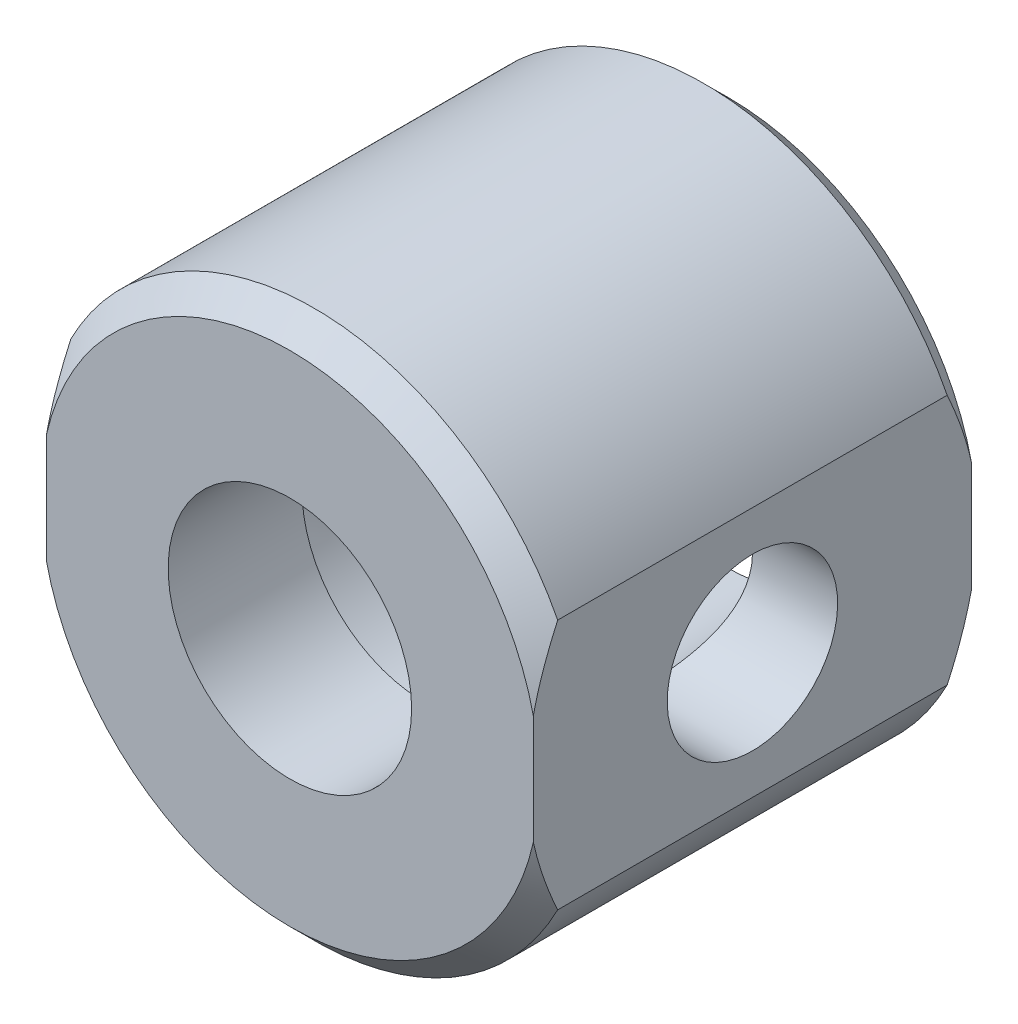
ISO-10303-21;
HEADER;
FILE_DESCRIPTION(('STEP AP214'),'2;1');
FILE_NAME('part.step','',(''),(''),'','','');
FILE_SCHEMA(('AUTOMOTIVE_DESIGN { 1 0 10303 214 1 1 1 1 }'));
ENDSEC;
DATA;
#1=APPLICATION_CONTEXT('core data for automotive mechanical design processes');
#2=APPLICATION_PROTOCOL_DEFINITION('international standard','automotive_design',2000,#1);
#3=PRODUCT_CONTEXT('',#1,'mechanical');
#4=PRODUCT('Part','Part','',(#3));
#5=PRODUCT_RELATED_PRODUCT_CATEGORY('part','',(#4));
#6=PRODUCT_DEFINITION_FORMATION('','',#4);
#7=PRODUCT_DEFINITION_CONTEXT('part definition',#1,'design');
#8=PRODUCT_DEFINITION('design','',#6,#7);
#9=PRODUCT_DEFINITION_SHAPE('','',#8);
#10=(LENGTH_UNIT() NAMED_UNIT(*) SI_UNIT(.MILLI.,.METRE.));
#11=(NAMED_UNIT(*) PLANE_ANGLE_UNIT() SI_UNIT($,.RADIAN.));
#12=(NAMED_UNIT(*) SI_UNIT($,.STERADIAN.) SOLID_ANGLE_UNIT());
#13=UNCERTAINTY_MEASURE_WITH_UNIT(LENGTH_MEASURE(1.E-05),#10,'distance_accuracy_value','');
#14=(GEOMETRIC_REPRESENTATION_CONTEXT(3) GLOBAL_UNCERTAINTY_ASSIGNED_CONTEXT((#13)) GLOBAL_UNIT_ASSIGNED_CONTEXT((#10,
#11,#12)) REPRESENTATION_CONTEXT('',''));
#15=CARTESIAN_POINT('',(0.,0.,0.));
#16=DIRECTION('',(0.,0.,1.));
#17=DIRECTION('',(1.,0.,0.));
#18=AXIS2_PLACEMENT_3D('',#15,#16,#17);
#19=CARTESIAN_POINT('',(0.,0.,36.));
#20=DIRECTION('',(0.,0.,-1.));
#21=DIRECTION('',(-1.,0.,0.));
#22=AXIS2_PLACEMENT_3D('',#19,#20,#21);
#23=CYLINDRICAL_SURFACE('',#22,22.5);
#24=CARTESIAN_POINT('',(0.,0.,34.));
#25=DIRECTION('',(0.,0.,1.));
#26=DIRECTION('',(1.,0.,0.));
#27=AXIS2_PLACEMENT_3D('',#24,#25,#26);
#28=CIRCLE('',#27,22.5);
#29=CARTESIAN_POINT('',(20.,-10.3077640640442,34.));
#30=VERTEX_POINT('',#29);
#31=CARTESIAN_POINT('',(-20.,-10.3077640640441,34.));
#32=VERTEX_POINT('',#31);
#33=EDGE_CURVE('E200',#30,#32,#28,.F.);
#34=ORIENTED_EDGE('',*,*,#33,.T.);
#35=DIRECTION('',(0.,0.,-1.));
#36=VECTOR('',#35,1.);
#37=CARTESIAN_POINT('',(-20.,-10.3077640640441,36.));
#38=LINE('',#37,#36);
#39=CARTESIAN_POINT('',(-20.,-10.3077640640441,2.));
#40=VERTEX_POINT('',#39);
#41=EDGE_CURVE('E179',#32,#40,#38,.T.);
#42=ORIENTED_EDGE('',*,*,#41,.T.);
#43=CARTESIAN_POINT('',(0.,0.,2.));
#44=DIRECTION('',(0.,0.,1.));
#45=DIRECTION('',(1.,0.,0.));
#46=AXIS2_PLACEMENT_3D('',#43,#44,#45);
#47=CIRCLE('',#46,22.5);
#48=CARTESIAN_POINT('',(20.,-10.3077640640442,2.));
#49=VERTEX_POINT('',#48);
#50=EDGE_CURVE('E202',#40,#49,#47,.T.);
#51=ORIENTED_EDGE('',*,*,#50,.T.);
#52=DIRECTION('',(0.,0.,-1.));
#53=VECTOR('',#52,1.);
#54=CARTESIAN_POINT('',(20.,-10.3077640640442,36.));
#55=LINE('',#54,#53);
#56=EDGE_CURVE('E113',#49,#30,#55,.F.);
#57=ORIENTED_EDGE('',*,*,#56,.T.);
#58=EDGE_LOOP('',(#34,#42,#51,#57));
#59=FACE_BOUND('',#58,.T.);
#60=ADVANCED_FACE('F34',(#59),#23,.T.);
#61=CARTESIAN_POINT('',(0.,0.,36.));
#62=DIRECTION('',(0.,0.,-1.));
#63=DIRECTION('',(-1.,0.,0.));
#64=AXIS2_PLACEMENT_3D('',#61,#62,#63);
#65=CONICAL_SURFACE('',#64,20.5,0.785398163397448);
#66=CARTESIAN_POINT('',(-20.,-14.5963129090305,31.7401060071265));
#67=CARTESIAN_POINT('',(-20.,-14.2319509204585,31.9548727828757));
#68=CARTESIAN_POINT('',(-20.,-13.8652917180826,32.1658043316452));
#69=CARTESIAN_POINT('',(-20.,-13.1269176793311,32.57883982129));
#70=CARTESIAN_POINT('',(-20.,-12.7552015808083,32.7809415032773));
#71=CARTESIAN_POINT('',(-20.,-12.0049087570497,33.1758542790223));
#72=CARTESIAN_POINT('',(-20.,-11.6263102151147,33.3686240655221));
#73=CARTESIAN_POINT('',(-20.,-10.8634186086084,33.742511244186));
#74=CARTESIAN_POINT('',(-20.,-10.4791259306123,33.9236294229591));
#75=CARTESIAN_POINT('',(-20.,-9.6978907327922,34.2755673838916));
#76=CARTESIAN_POINT('',(-20.,-9.30084429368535,34.4461573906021));
#77=CARTESIAN_POINT('',(-20.,-8.50030394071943,34.7716444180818));
#78=CARTESIAN_POINT('',(-20.,-8.09680947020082,34.9265400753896));
#79=CARTESIAN_POINT('',(-20.,-7.28401426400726,35.2182415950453));
#80=CARTESIAN_POINT('',(-20.,-6.87472364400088,35.3550754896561));
#81=CARTESIAN_POINT('',(-20.,-6.05001521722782,35.6086440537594));
#82=CARTESIAN_POINT('',(-20.,-5.6345984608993,35.7253821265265));
#83=CARTESIAN_POINT('',(-20.,-4.71844460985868,35.9565876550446));
#84=CARTESIAN_POINT('',(-20.,-4.21651485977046,36.0663955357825));
#85=CARTESIAN_POINT('',(-20.,-3.2061367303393,36.2507363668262));
#86=CARTESIAN_POINT('',(-20.,-2.69768803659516,36.3252676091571));
#87=CARTESIAN_POINT('',(-20.,-1.68098905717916,36.4357861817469));
#88=CARTESIAN_POINT('',(-20.,-1.17277461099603,36.4720992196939));
#89=CARTESIAN_POINT('',(-20.,-0.155045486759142,36.5058680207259));
#90=CARTESIAN_POINT('',(-20.,0.354469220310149,36.5033229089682));
#91=CARTESIAN_POINT('',(-20.,1.45241488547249,36.4559673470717));
#92=CARTESIAN_POINT('',(-20.,2.04056707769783,36.4045283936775));
#93=CARTESIAN_POINT('',(-20.,3.21044479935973,36.2522797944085));
#94=CARTESIAN_POINT('',(-20.,3.79216900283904,36.1514601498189));
#95=CARTESIAN_POINT('',(-20.,4.9532445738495,35.9036719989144));
#96=CARTESIAN_POINT('',(-20.,5.53247403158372,35.7561389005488));
#97=CARTESIAN_POINT('',(-20.,6.67906381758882,35.4213593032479));
#98=CARTESIAN_POINT('',(-20.,7.24642645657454,35.2341206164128));
#99=CARTESIAN_POINT('',(-20.,8.51334710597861,34.7734123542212));
#100=CARTESIAN_POINT('',(-20.,9.20932637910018,34.4901533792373));
#101=CARTESIAN_POINT('',(-20.,10.5826053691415,33.8811500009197));
#102=CARTESIAN_POINT('',(-20.,11.2598951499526,33.5553835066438));
#103=CARTESIAN_POINT('',(-20.,12.5995112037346,32.8691801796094));
#104=CARTESIAN_POINT('',(-20.,13.2617773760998,32.5086269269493));
#105=CARTESIAN_POINT('',(-20.,14.5708657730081,31.7609305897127));
#106=CARTESIAN_POINT('',(-20.,15.2176907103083,31.3737922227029));
#107=CARTESIAN_POINT('',(-20.,16.4687358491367,30.5965195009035));
#108=CARTESIAN_POINT('',(-20.,17.0735498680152,30.2073359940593));
#109=CARTESIAN_POINT('',(-20.,18.2727911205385,29.4132314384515));
#110=CARTESIAN_POINT('',(-20.,18.8672175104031,29.0083091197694));
#111=CARTESIAN_POINT('',(-20.,20.0420614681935,28.189074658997));
#112=CARTESIAN_POINT('',(-20.,20.6225551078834,27.774871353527));
#113=CARTESIAN_POINT('',(-20.,21.4874680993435,27.1457457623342));
#114=CARTESIAN_POINT('',(-20.,21.7747644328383,26.9347615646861));
#115=CARTESIAN_POINT('',(-20.,22.3475672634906,26.5103884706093));
#116=CARTESIAN_POINT('',(-20.,22.6330737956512,26.296999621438));
#117=CARTESIAN_POINT('',(-20.,22.9177544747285,26.082513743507));
#118=B_SPLINE_CURVE_WITH_KNOTS('',3,(#66,#67,#68,#69,#70,#71,#72,#73,#74,#75,#76,#77,#78,#79,
#80,#81,#82,#83,#84,#85,#86,#87,#88,#89,#90,#91,#92,#93,#94,#95,#96,#97,#98,#99,#100,#101,#102,
#103,#104,#105,#106,#107,#108,#109,#110,#111,#112,#113,#114,#115,#116,#117),.UNSPECIFIED.,.F.,
.F.,(4,2,2,2,2,2,2,2,2,2,2,2,2,2,2,2,2,2,2,2,2,2,2,2,2,4),(0.,1.26886514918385,2.53805302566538,
3.81242352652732,5.08670790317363,6.38283753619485,7.67907967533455,8.97328575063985,
10.2672724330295,11.807502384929,13.3478069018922,14.8748754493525,16.4019783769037,
18.1708834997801,19.9401469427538,21.7316675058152,23.5228359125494,25.7752229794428,
28.0287852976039,30.2901700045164,32.5511544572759,34.7084944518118,36.8660088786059,
39.0052152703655,40.0745421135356,41.1438479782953),.UNSPECIFIED.);
#119=CARTESIAN_POINT('',(-20.,-4.49999999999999,36.));
#120=VERTEX_POINT('',#119);
#121=EDGE_CURVE('E172',#32,#120,#118,.T.);
#122=ORIENTED_EDGE('',*,*,#121,.F.);
#123=ORIENTED_EDGE('',*,*,#33,.F.);
#124=CARTESIAN_POINT('',(20.,-14.5963129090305,31.7401060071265));
#125=CARTESIAN_POINT('',(20.,-14.2319509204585,31.9548727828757));
#126=CARTESIAN_POINT('',(20.,-13.8652917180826,32.1658043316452));
#127=CARTESIAN_POINT('',(20.,-13.1269176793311,32.57883982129));
#128=CARTESIAN_POINT('',(20.,-12.7552015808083,32.7809415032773));
#129=CARTESIAN_POINT('',(20.,-12.0049087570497,33.1758542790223));
#130=CARTESIAN_POINT('',(20.,-11.6263102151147,33.3686240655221));
#131=CARTESIAN_POINT('',(20.,-10.8634186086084,33.742511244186));
#132=CARTESIAN_POINT('',(20.,-10.4791259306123,33.9236294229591));
#133=CARTESIAN_POINT('',(20.,-9.6978907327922,34.2755673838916));
#134=CARTESIAN_POINT('',(20.,-9.30084429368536,34.4461573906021));
#135=CARTESIAN_POINT('',(20.,-8.50030394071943,34.7716444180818));
#136=CARTESIAN_POINT('',(20.,-8.09680947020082,34.9265400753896));
#137=CARTESIAN_POINT('',(20.,-7.28401426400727,35.2182415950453));
#138=CARTESIAN_POINT('',(20.,-6.87472364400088,35.3550754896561));
#139=CARTESIAN_POINT('',(20.,-6.05001521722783,35.6086440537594));
#140=CARTESIAN_POINT('',(20.,-5.6345984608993,35.7253821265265));
#141=CARTESIAN_POINT('',(20.,-4.71844460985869,35.9565876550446));
#142=CARTESIAN_POINT('',(20.,-4.21651485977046,36.0663955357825));
#143=CARTESIAN_POINT('',(20.,-3.2061367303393,36.2507363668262));
#144=CARTESIAN_POINT('',(20.,-2.69768803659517,36.3252676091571));
#145=CARTESIAN_POINT('',(20.,-1.68098905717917,36.4357861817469));
#146=CARTESIAN_POINT('',(20.,-1.17277461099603,36.4720992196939));
#147=CARTESIAN_POINT('',(20.,-0.155045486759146,36.5058680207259));
#148=CARTESIAN_POINT('',(20.,0.354469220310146,36.5033229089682));
#149=CARTESIAN_POINT('',(20.,1.45241488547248,36.4559673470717));
#150=CARTESIAN_POINT('',(20.,2.04056707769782,36.4045283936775));
#151=CARTESIAN_POINT('',(20.,3.21044479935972,36.2522797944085));
#152=CARTESIAN_POINT('',(20.,3.79216900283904,36.1514601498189));
#153=CARTESIAN_POINT('',(20.,4.95324457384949,35.9036719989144));
#154=CARTESIAN_POINT('',(20.,5.53247403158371,35.7561389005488));
#155=CARTESIAN_POINT('',(20.,6.67906381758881,35.4213593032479));
#156=CARTESIAN_POINT('',(20.,7.24642645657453,35.2341206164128));
#157=CARTESIAN_POINT('',(20.,8.5133471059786,34.7734123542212));
#158=CARTESIAN_POINT('',(20.,9.20932637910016,34.4901533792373));
#159=CARTESIAN_POINT('',(20.,10.5826053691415,33.8811500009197));
#160=CARTESIAN_POINT('',(20.,11.2598951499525,33.5553835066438));
#161=CARTESIAN_POINT('',(20.,12.5995112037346,32.8691801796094));
#162=CARTESIAN_POINT('',(20.,13.2617773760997,32.5086269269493));
#163=CARTESIAN_POINT('',(20.,14.5708657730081,31.7609305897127));
#164=CARTESIAN_POINT('',(20.,15.2176907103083,31.3737922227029));
#165=CARTESIAN_POINT('',(20.,16.4687358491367,30.5965195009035));
#166=CARTESIAN_POINT('',(20.,17.0735498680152,30.2073359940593));
#167=CARTESIAN_POINT('',(20.,18.2727911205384,29.4132314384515));
#168=CARTESIAN_POINT('',(20.,18.8672175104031,29.0083091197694));
#169=CARTESIAN_POINT('',(20.,20.0420614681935,28.1890746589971));
#170=CARTESIAN_POINT('',(20.,20.6225551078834,27.774871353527));
#171=CARTESIAN_POINT('',(20.,21.4874680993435,27.1457457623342));
#172=CARTESIAN_POINT('',(20.,21.7747644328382,26.9347615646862));
#173=CARTESIAN_POINT('',(20.,22.3475672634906,26.5103884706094));
#174=CARTESIAN_POINT('',(20.,22.6330737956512,26.296999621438));
#175=CARTESIAN_POINT('',(20.,22.9177544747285,26.082513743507));
#176=B_SPLINE_CURVE_WITH_KNOTS('',3,(#124,#125,#126,#127,#128,#129,#130,#131,#132,#133,#134,
#135,#136,#137,#138,#139,#140,#141,#142,#143,#144,#145,#146,#147,#148,#149,#150,#151,#152,#153,
#154,#155,#156,#157,#158,#159,#160,#161,#162,#163,#164,#165,#166,#167,#168,#169,#170,#171,#172,
#173,#174,#175),.UNSPECIFIED.,.F.,.F.,(4,2,2,2,2,2,2,2,2,2,2,2,2,2,2,2,2,2,2,2,2,2,2,2,2,4),(0.,
1.26886514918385,2.53805302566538,3.81242352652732,5.08670790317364,6.38283753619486,
7.67907967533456,8.97328575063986,10.2672724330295,11.807502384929,13.3478069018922,
14.8748754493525,16.4019783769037,18.1708834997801,19.9401469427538,21.7316675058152,
23.5228359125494,25.7752229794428,28.0287852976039,30.2901700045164,32.5511544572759,
34.7084944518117,36.8660088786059,39.0052152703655,40.0745421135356,41.1438479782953),.UNSPECIFIED.);
#177=CARTESIAN_POINT('',(20.,-4.5,36.));
#178=VERTEX_POINT('',#177);
#179=EDGE_CURVE('E159',#178,#30,#176,.F.);
#180=ORIENTED_EDGE('',*,*,#179,.F.);
#181=CARTESIAN_POINT('',(0.,0.,36.));
#182=DIRECTION('',(0.,0.,1.));
#183=DIRECTION('',(1.,0.,0.));
#184=AXIS2_PLACEMENT_3D('',#181,#182,#183);
#185=CIRCLE('',#184,20.5);
#186=EDGE_CURVE('E194',#120,#178,#185,.T.);
#187=ORIENTED_EDGE('',*,*,#186,.F.);
#188=EDGE_LOOP('',(#122,#123,#180,#187));
#189=FACE_BOUND('',#188,.T.);
#190=ADVANCED_FACE('F168',(#189),#65,.T.);
#191=CARTESIAN_POINT('',(0.,0.,2.));
#192=DIRECTION('',(0.,0.,1.));
#193=DIRECTION('',(1.,0.,0.));
#194=AXIS2_PLACEMENT_3D('',#191,#192,#193);
#195=CONICAL_SURFACE('',#194,22.5,0.785398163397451);
#196=CARTESIAN_POINT('',(-20.,-14.5963129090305,4.25989399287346));
#197=CARTESIAN_POINT('',(-20.,-14.2319509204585,4.04512721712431));
#198=CARTESIAN_POINT('',(-20.,-13.8652917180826,3.83419566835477));
#199=CARTESIAN_POINT('',(-20.,-13.1269176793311,3.42116017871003));
#200=CARTESIAN_POINT('',(-20.,-12.7552015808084,3.21905849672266));
#201=CARTESIAN_POINT('',(-20.,-12.0049087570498,2.82414572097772));
#202=CARTESIAN_POINT('',(-20.,-11.6263102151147,2.63137593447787));
#203=CARTESIAN_POINT('',(-20.,-10.8634186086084,2.25748875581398));
#204=CARTESIAN_POINT('',(-20.,-10.4791259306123,2.07637057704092));
#205=CARTESIAN_POINT('',(-20.,-9.69789073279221,1.72443261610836));
#206=CARTESIAN_POINT('',(-20.,-9.30084429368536,1.55384260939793));
#207=CARTESIAN_POINT('',(-20.,-8.50030394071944,1.22835558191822));
#208=CARTESIAN_POINT('',(-20.,-8.09680947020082,1.07345992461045));
#209=CARTESIAN_POINT('',(-20.,-7.28401426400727,0.781758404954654));
#210=CARTESIAN_POINT('',(-20.,-6.87472364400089,0.644924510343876));
#211=CARTESIAN_POINT('',(-20.,-6.05001521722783,0.391355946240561));
#212=CARTESIAN_POINT('',(-20.,-5.6345984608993,0.2746178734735));
#213=CARTESIAN_POINT('',(-20.,-4.71844460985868,0.043412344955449));
#214=CARTESIAN_POINT('',(-20.,-4.21651485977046,-0.0663955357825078));
#215=CARTESIAN_POINT('',(-20.,-3.2061367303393,-0.250736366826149));
#216=CARTESIAN_POINT('',(-20.,-2.69768803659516,-0.325267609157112));
#217=CARTESIAN_POINT('',(-20.,-1.68098905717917,-0.435786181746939));
#218=CARTESIAN_POINT('',(-20.,-1.17277461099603,-0.472099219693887));
#219=CARTESIAN_POINT('',(-20.,-0.155045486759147,-0.505868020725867));
#220=CARTESIAN_POINT('',(-20.,0.354469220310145,-0.503322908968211));
#221=CARTESIAN_POINT('',(-20.,1.45241488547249,-0.455967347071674));
#222=CARTESIAN_POINT('',(-20.,2.04056707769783,-0.404528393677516));
#223=CARTESIAN_POINT('',(-20.,3.21044479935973,-0.252279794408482));
#224=CARTESIAN_POINT('',(-20.,3.79216900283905,-0.151460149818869));
#225=CARTESIAN_POINT('',(-20.,4.95324457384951,0.0963280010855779));
#226=CARTESIAN_POINT('',(-20.,5.53247403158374,0.243861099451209));
#227=CARTESIAN_POINT('',(-20.,6.67906381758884,0.578640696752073));
#228=CARTESIAN_POINT('',(-20.,7.24642645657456,0.765879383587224));
#229=CARTESIAN_POINT('',(-20.,8.51334710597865,1.2265876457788));
#230=CARTESIAN_POINT('',(-20.,9.20932637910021,1.50984662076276));
#231=CARTESIAN_POINT('',(-20.,10.5826053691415,2.11884999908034));
#232=CARTESIAN_POINT('',(-20.,11.2598951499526,2.44461649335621));
#233=CARTESIAN_POINT('',(-20.,12.5995112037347,3.13081982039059));
#234=CARTESIAN_POINT('',(-20.,13.2617773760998,3.4913730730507));
#235=CARTESIAN_POINT('',(-20.,14.5708657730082,4.23906941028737));
#236=CARTESIAN_POINT('',(-20.,15.2176907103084,4.62620777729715));
#237=CARTESIAN_POINT('',(-20.,16.4687358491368,5.40348049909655));
#238=CARTESIAN_POINT('',(-20.,17.0735498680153,5.79266400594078));
#239=CARTESIAN_POINT('',(-20.,18.2727911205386,6.58676856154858));
#240=CARTESIAN_POINT('',(-20.,18.8672175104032,6.99169088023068));
#241=CARTESIAN_POINT('',(-20.,20.0420614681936,7.81092534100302));
#242=CARTESIAN_POINT('',(-20.,20.6225551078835,8.22512864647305));
#243=CARTESIAN_POINT('',(-20.,21.4874680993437,8.85425423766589));
#244=CARTESIAN_POINT('',(-20.,21.7747644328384,9.06523843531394));
#245=CARTESIAN_POINT('',(-20.,22.3475672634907,9.48961152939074));
#246=CARTESIAN_POINT('',(-20.,22.6330737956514,9.70300037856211));
#247=CARTESIAN_POINT('',(-20.,22.9177544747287,9.91748625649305));
#248=B_SPLINE_CURVE_WITH_KNOTS('',3,(#196,#197,#198,#199,#200,#201,#202,#203,#204,#205,#206,
#207,#208,#209,#210,#211,#212,#213,#214,#215,#216,#217,#218,#219,#220,#221,#222,#223,#224,#225,
#226,#227,#228,#229,#230,#231,#232,#233,#234,#235,#236,#237,#238,#239,#240,#241,#242,#243,#244,
#245,#246,#247),.UNSPECIFIED.,.F.,.F.,(4,2,2,2,2,2,2,2,2,2,2,2,2,2,2,2,2,2,2,2,2,2,2,2,2,4),(0.,
1.26886514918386,2.53805302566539,3.81242352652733,5.08670790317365,6.38283753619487,
7.67907967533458,8.97328575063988,10.2672724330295,11.807502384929,13.3478069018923,
14.8748754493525,16.4019783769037,18.1708834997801,19.9401469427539,21.7316675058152,
23.5228359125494,25.7752229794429,28.028785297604,30.2901700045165,32.551154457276,
34.7084944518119,36.8660088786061,39.0052152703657,40.0745421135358,41.1438479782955),.UNSPECIFIED.);
#249=CARTESIAN_POINT('',(-20.,10.3077640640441,2.));
#250=VERTEX_POINT('',#249);
#251=CARTESIAN_POINT('',(-20.,4.49999999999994,0.));
#252=VERTEX_POINT('',#251);
#253=EDGE_CURVE('E11',#250,#252,#248,.F.);
#254=ORIENTED_EDGE('',*,*,#253,.F.);
#255=CARTESIAN_POINT('',(20.,10.3077640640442,2.));
#256=VERTEX_POINT('',#255);
#257=EDGE_CURVE('E133',#256,#250,#47,.T.);
#258=ORIENTED_EDGE('',*,*,#257,.F.);
#259=CARTESIAN_POINT('',(20.,-14.5963129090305,4.25989399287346));
#260=CARTESIAN_POINT('',(20.,-14.2319509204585,4.04512721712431));
#261=CARTESIAN_POINT('',(20.,-13.8652917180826,3.83419566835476));
#262=CARTESIAN_POINT('',(20.,-13.1269176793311,3.42116017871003));
#263=CARTESIAN_POINT('',(20.,-12.7552015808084,3.21905849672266));
#264=CARTESIAN_POINT('',(20.,-12.0049087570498,2.82414572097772));
#265=CARTESIAN_POINT('',(20.,-11.6263102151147,2.63137593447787));
#266=CARTESIAN_POINT('',(20.,-10.8634186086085,2.25748875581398));
#267=CARTESIAN_POINT('',(20.,-10.4791259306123,2.07637057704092));
#268=CARTESIAN_POINT('',(20.,-9.69789073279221,1.72443261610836));
#269=CARTESIAN_POINT('',(20.,-9.30084429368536,1.55384260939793));
#270=CARTESIAN_POINT('',(20.,-8.50030394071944,1.22835558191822));
#271=CARTESIAN_POINT('',(20.,-8.09680947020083,1.07345992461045));
#272=CARTESIAN_POINT('',(20.,-7.28401426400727,0.781758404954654));
#273=CARTESIAN_POINT('',(20.,-6.87472364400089,0.644924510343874));
#274=CARTESIAN_POINT('',(20.,-6.05001521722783,0.391355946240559));
#275=CARTESIAN_POINT('',(20.,-5.6345984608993,0.2746178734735));
#276=CARTESIAN_POINT('',(20.,-4.71844460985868,0.0434123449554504));
#277=CARTESIAN_POINT('',(20.,-4.21651485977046,-0.066395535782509));
#278=CARTESIAN_POINT('',(20.,-3.2061367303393,-0.250736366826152));
#279=CARTESIAN_POINT('',(20.,-2.69768803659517,-0.325267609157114));
#280=CARTESIAN_POINT('',(20.,-1.68098905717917,-0.435786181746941));
#281=CARTESIAN_POINT('',(20.,-1.17277461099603,-0.472099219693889));
#282=CARTESIAN_POINT('',(20.,-0.155045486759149,-0.505868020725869));
#283=CARTESIAN_POINT('',(20.,0.354469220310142,-0.503322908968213));
#284=CARTESIAN_POINT('',(20.,1.45241488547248,-0.455967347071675));
#285=CARTESIAN_POINT('',(20.,2.04056707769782,-0.404528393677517));
#286=CARTESIAN_POINT('',(20.,3.21044479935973,-0.252279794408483));
#287=CARTESIAN_POINT('',(20.,3.79216900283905,-0.151460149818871));
#288=CARTESIAN_POINT('',(20.,4.95324457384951,0.0963280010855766));
#289=CARTESIAN_POINT('',(20.,5.53247403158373,0.243861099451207));
#290=CARTESIAN_POINT('',(20.,6.67906381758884,0.578640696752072));
#291=CARTESIAN_POINT('',(20.,7.24642645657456,0.765879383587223));
#292=CARTESIAN_POINT('',(20.,8.51334710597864,1.2265876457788));
#293=CARTESIAN_POINT('',(20.,9.20932637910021,1.50984662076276));
#294=CARTESIAN_POINT('',(20.,10.5826053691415,2.11884999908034));
#295=CARTESIAN_POINT('',(20.,11.2598951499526,2.44461649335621));
#296=CARTESIAN_POINT('',(20.,12.5995112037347,3.13081982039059));
#297=CARTESIAN_POINT('',(20.,13.2617773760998,3.49137307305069));
#298=CARTESIAN_POINT('',(20.,14.5708657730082,4.23906941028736));
#299=CARTESIAN_POINT('',(20.,15.2176907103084,4.62620777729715));
#300=CARTESIAN_POINT('',(20.,16.4687358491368,5.40348049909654));
#301=CARTESIAN_POINT('',(20.,17.0735498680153,5.79266400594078));
#302=CARTESIAN_POINT('',(20.,18.2727911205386,6.58676856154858));
#303=CARTESIAN_POINT('',(20.,18.8672175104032,6.99169088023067));
#304=CARTESIAN_POINT('',(20.,20.0420614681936,7.81092534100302));
#305=CARTESIAN_POINT('',(20.,20.6225551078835,8.22512864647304));
#306=CARTESIAN_POINT('',(20.,21.4874680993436,8.85425423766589));
#307=CARTESIAN_POINT('',(20.,21.7747644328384,9.06523843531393));
#308=CARTESIAN_POINT('',(20.,22.3475672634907,9.48961152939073));
#309=CARTESIAN_POINT('',(20.,22.6330737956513,9.7030003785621));
#310=CARTESIAN_POINT('',(20.,22.9177544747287,9.91748625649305));
#311=B_SPLINE_CURVE_WITH_KNOTS('',3,(#259,#260,#261,#262,#263,#264,#265,#266,#267,#268,#269,
#270,#271,#272,#273,#274,#275,#276,#277,#278,#279,#280,#281,#282,#283,#284,#285,#286,#287,#288,
#289,#290,#291,#292,#293,#294,#295,#296,#297,#298,#299,#300,#301,#302,#303,#304,#305,#306,#307,
#308,#309,#310),.UNSPECIFIED.,.F.,.F.,(4,2,2,2,2,2,2,2,2,2,2,2,2,2,2,2,2,2,2,2,2,2,2,2,2,4),(0.,
1.26886514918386,2.53805302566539,3.81242352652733,5.08670790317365,6.38283753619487,
7.67907967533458,8.97328575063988,10.2672724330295,11.807502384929,13.3478069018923,
14.8748754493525,16.4019783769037,18.1708834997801,19.9401469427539,21.7316675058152,
23.5228359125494,25.7752229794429,28.028785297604,30.2901700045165,32.551154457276,
34.7084944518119,36.8660088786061,39.0052152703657,40.0745421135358,41.1438479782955),.UNSPECIFIED.);
#312=CARTESIAN_POINT('',(20.,4.49999999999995,0.));
#313=VERTEX_POINT('',#312);
#314=EDGE_CURVE('E118',#313,#256,#311,.T.);
#315=ORIENTED_EDGE('',*,*,#314,.F.);
#316=CARTESIAN_POINT('',(0.,0.,0.));
#317=DIRECTION('',(0.,0.,1.));
#318=DIRECTION('',(1.,0.,0.));
#319=AXIS2_PLACEMENT_3D('',#316,#317,#318);
#320=CIRCLE('',#319,20.5);
#321=EDGE_CURVE('E127',#252,#313,#320,.F.);
#322=ORIENTED_EDGE('',*,*,#321,.F.);
#323=EDGE_LOOP('',(#254,#258,#315,#322));
#324=FACE_BOUND('',#323,.T.);
#325=ADVANCED_FACE('F253',(#324),#195,.T.);
#326=CARTESIAN_POINT('',(0.,0.,0.));
#327=DIRECTION('',(0.,0.,1.));
#328=DIRECTION('',(1.,0.,0.));
#329=AXIS2_PLACEMENT_3D('',#326,#327,#328);
#330=PLANE('',#329);
#331=CARTESIAN_POINT('',(20.,-4.49999999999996,0.));
#332=VERTEX_POINT('',#331);
#333=CARTESIAN_POINT('',(-20.,-4.49999999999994,0.));
#334=VERTEX_POINT('',#333);
#335=EDGE_CURVE('E125',#332,#334,#320,.F.);
#336=ORIENTED_EDGE('',*,*,#335,.T.);
#337=DIRECTION('',(0.,-1.,0.));
#338=VECTOR('',#337,1.);
#339=CARTESIAN_POINT('',(-20.,-21.5227891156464,0.));
#340=LINE('',#339,#338);
#341=EDGE_CURVE('E128',#252,#334,#340,.T.);
#342=ORIENTED_EDGE('',*,*,#341,.F.);
#343=ORIENTED_EDGE('',*,*,#321,.T.);
#344=DIRECTION('',(0.,1.,0.));
#345=VECTOR('',#344,1.);
#346=CARTESIAN_POINT('',(20.,24.0302721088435,0.));
#347=LINE('',#346,#345);
#348=EDGE_CURVE('E110',#332,#313,#347,.T.);
#349=ORIENTED_EDGE('',*,*,#348,.F.);
#350=EDGE_LOOP('',(#336,#342,#343,#349));
#351=FACE_BOUND('',#350,.T.);
#352=CARTESIAN_POINT('',(0.,0.,0.));
#353=DIRECTION('',(0.,0.,1.));
#354=DIRECTION('',(1.,0.,0.));
#355=AXIS2_PLACEMENT_3D('',#352,#353,#354);
#356=CIRCLE('',#355,13.);
#357=CARTESIAN_POINT('',(13.,0.,0.));
#358=VERTEX_POINT('',#357);
#359=EDGE_CURVE('E187',#358,#358,#356,.T.);
#360=ORIENTED_EDGE('',*,*,#359,.T.);
#361=EDGE_LOOP('',(#360));
#362=FACE_BOUND('',#361,.T.);
#363=ADVANCED_FACE('F122',(#351,#362),#330,.F.);
#364=ORIENTED_EDGE('',*,*,#257,.T.);
#365=DIRECTION('',(0.,0.,-1.));
#366=VECTOR('',#365,1.);
#367=CARTESIAN_POINT('',(-20.,10.3077640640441,36.));
#368=LINE('',#367,#366);
#369=CARTESIAN_POINT('',(-20.,10.3077640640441,34.));
#370=VERTEX_POINT('',#369);
#371=EDGE_CURVE('E178',#250,#370,#368,.F.);
#372=ORIENTED_EDGE('',*,*,#371,.T.);
#373=CARTESIAN_POINT('',(20.,10.3077640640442,34.));
#374=VERTEX_POINT('',#373);
#375=EDGE_CURVE('E199',#370,#374,#28,.F.);
#376=ORIENTED_EDGE('',*,*,#375,.T.);
#377=DIRECTION('',(0.,0.,-1.));
#378=VECTOR('',#377,1.);
#379=CARTESIAN_POINT('',(20.,10.3077640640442,36.));
#380=LINE('',#379,#378);
#381=EDGE_CURVE('E158',#374,#256,#380,.T.);
#382=ORIENTED_EDGE('',*,*,#381,.T.);
#383=EDGE_LOOP('',(#364,#372,#376,#382));
#384=FACE_BOUND('',#383,.T.);
#385=ADVANCED_FACE('F36',(#384),#23,.T.);
#386=CARTESIAN_POINT('',(0.,0.,36.));
#387=DIRECTION('',(0.,0.,1.));
#388=DIRECTION('',(1.,0.,0.));
#389=AXIS2_PLACEMENT_3D('',#386,#387,#388);
#390=PLANE('',#389);
#391=DIRECTION('',(0.,-1.,0.));
#392=VECTOR('',#391,1.);
#393=CARTESIAN_POINT('',(-20.,-21.5227891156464,36.));
#394=LINE('',#393,#392);
#395=CARTESIAN_POINT('',(-20.,4.49999999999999,36.));
#396=VERTEX_POINT('',#395);
#397=EDGE_CURVE('E224',#396,#120,#394,.T.);
#398=ORIENTED_EDGE('',*,*,#397,.T.);
#399=ORIENTED_EDGE('',*,*,#186,.T.);
#400=DIRECTION('',(0.,1.,0.));
#401=VECTOR('',#400,1.);
#402=CARTESIAN_POINT('',(20.,24.0302721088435,36.));
#403=LINE('',#402,#401);
#404=CARTESIAN_POINT('',(20.,4.5,36.));
#405=VERTEX_POINT('',#404);
#406=EDGE_CURVE('E216',#178,#405,#403,.T.);
#407=ORIENTED_EDGE('',*,*,#406,.T.);
#408=EDGE_CURVE('E197',#405,#396,#185,.T.);
#409=ORIENTED_EDGE('',*,*,#408,.T.);
#410=EDGE_LOOP('',(#398,#399,#407,#409));
#411=FACE_BOUND('',#410,.T.);
#412=CARTESIAN_POINT('',(0.,0.,36.));
#413=DIRECTION('',(0.,0.,1.));
#414=DIRECTION('',(1.,0.,0.));
#415=AXIS2_PLACEMENT_3D('',#412,#413,#414);
#416=CIRCLE('',#415,10.);
#417=CARTESIAN_POINT('',(10.,0.,36.));
#418=VERTEX_POINT('',#417);
#419=EDGE_CURVE('E183',#418,#418,#416,.T.);
#420=ORIENTED_EDGE('',*,*,#419,.F.);
#421=EDGE_LOOP('',(#420));
#422=FACE_BOUND('',#421,.T.);
#423=ADVANCED_FACE('F221',(#411,#422),#390,.T.);
#424=CARTESIAN_POINT('',(0.,0.,25.));
#425=DIRECTION('',(0.,0.,-1.));
#426=DIRECTION('',(-1.,0.,0.));
#427=AXIS2_PLACEMENT_3D('',#424,#425,#426);
#428=CYLINDRICAL_SURFACE('',#427,13.);
#429=CARTESIAN_POINT('',(0.,0.,25.));
#430=DIRECTION('',(0.,0.,1.));
#431=DIRECTION('',(1.,0.,0.));
#432=AXIS2_PLACEMENT_3D('',#429,#430,#431);
#433=CIRCLE('',#432,13.);
#434=CARTESIAN_POINT('',(13.,0.,25.));
#435=VERTEX_POINT('',#434);
#436=CARTESIAN_POINT('',(-13.,0.,25.));
#437=VERTEX_POINT('',#436);
#438=EDGE_CURVE('E191',#435,#437,#433,.T.);
#439=ORIENTED_EDGE('',*,*,#438,.T.);
#440=CARTESIAN_POINT('',(-13.,0.,25.));
#441=CARTESIAN_POINT('',(-13.0000009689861,-0.182338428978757,25.000001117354));
#442=CARTESIAN_POINT('',(-12.996155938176,-0.364663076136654,24.9928685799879));
#443=CARTESIAN_POINT('',(-12.9808762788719,-0.72794718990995,24.9644306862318));
#444=CARTESIAN_POINT('',(-12.969439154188,-0.90890618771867,24.94312066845));
#445=CARTESIAN_POINT('',(-12.9392502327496,-1.26820528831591,24.8865642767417));
#446=CARTESIAN_POINT('',(-12.9204906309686,-1.44654238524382,24.8513030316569));
#447=CARTESIAN_POINT('',(-12.8761210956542,-1.7991968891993,24.7672569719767));
#448=CARTESIAN_POINT('',(-12.8505083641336,-1.97351262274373,24.7184666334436));
#449=CARTESIAN_POINT('',(-12.7931824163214,-2.3161404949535,24.608156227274));
#450=CARTESIAN_POINT('',(-12.7614973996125,-2.48447627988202,24.5466949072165));
#451=CARTESIAN_POINT('',(-12.6926823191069,-2.81502698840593,24.4115173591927));
#452=CARTESIAN_POINT('',(-12.6555501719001,-2.97723954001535,24.3377964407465));
#453=CARTESIAN_POINT('',(-12.5372125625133,-3.45324174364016,24.0992517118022));
#454=CARTESIAN_POINT('',(-12.4490059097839,-3.75673978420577,23.9169339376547));
#455=CARTESIAN_POINT('',(-12.2549807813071,-4.34964558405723,23.4974038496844));
#456=CARTESIAN_POINT('',(-12.1483786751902,-4.63675068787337,23.2573341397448));
#457=CARTESIAN_POINT('',(-11.9316650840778,-5.16893605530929,22.7350883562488));
#458=CARTESIAN_POINT('',(-11.8215505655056,-5.41397875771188,22.45287506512));
#459=CARTESIAN_POINT('',(-11.6567529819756,-5.75658529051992,21.9879184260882));
#460=CARTESIAN_POINT('',(-11.5995482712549,-5.87068500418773,21.8180008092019));
#461=CARTESIAN_POINT('',(-11.4890392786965,-6.08411005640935,21.4677987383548));
#462=CARTESIAN_POINT('',(-11.4357358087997,-6.18343232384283,21.2875121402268));
#463=CARTESIAN_POINT('',(-11.3349458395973,-6.366310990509,20.917642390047));
#464=CARTESIAN_POINT('',(-11.2874570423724,-6.44987362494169,20.7280629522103));
#465=CARTESIAN_POINT('',(-11.2001669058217,-6.60028994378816,20.3407861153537));
#466=CARTESIAN_POINT('',(-11.1603607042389,-6.66715420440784,20.1430939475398));
#467=CARTESIAN_POINT('',(-11.0923563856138,-6.77965207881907,19.7535162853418));
#468=CARTESIAN_POINT('',(-11.0635889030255,-6.82635016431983,19.5620382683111));
#469=CARTESIAN_POINT('',(-11.0155756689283,-6.90356213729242,19.1746583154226));
#470=CARTESIAN_POINT('',(-10.9963294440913,-6.93407682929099,18.9787565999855));
#471=CARTESIAN_POINT('',(-10.9682764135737,-6.97836686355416,18.5845445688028));
#472=CARTESIAN_POINT('',(-10.9594578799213,-6.99216101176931,18.3862372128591));
#473=CARTESIAN_POINT('',(-10.9526574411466,-7.00280959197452,17.9889931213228));
#474=CARTESIAN_POINT('',(-10.9546741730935,-6.99966615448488,17.7900564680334));
#475=CARTESIAN_POINT('',(-10.9683642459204,-6.97818766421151,17.4222759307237));
#476=CARTESIAN_POINT('',(-10.9785992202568,-6.9621148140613,17.2532398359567));
#477=CARTESIAN_POINT('',(-11.0065503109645,-6.91784196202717,16.9173340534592));
#478=CARTESIAN_POINT('',(-11.0242688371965,-6.88963805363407,16.7504650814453));
#479=CARTESIAN_POINT('',(-11.0665872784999,-6.82145512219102,16.4200607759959));
#480=CARTESIAN_POINT('',(-11.0911868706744,-6.78147665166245,16.2565252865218));
#481=CARTESIAN_POINT('',(-11.146500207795,-6.69017036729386,15.9336549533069));
#482=CARTESIAN_POINT('',(-11.1772164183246,-6.63883797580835,15.7743218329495));
#483=CARTESIAN_POINT('',(-11.2445933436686,-6.52408149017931,15.4572859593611));
#484=CARTESIAN_POINT('',(-11.2813688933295,-6.46041852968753,15.2996941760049));
#485=CARTESIAN_POINT('',(-11.3593599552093,-6.32228060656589,14.9904369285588));
#486=CARTESIAN_POINT('',(-11.4005769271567,-6.24780208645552,14.8387734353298));
#487=CARTESIAN_POINT('',(-11.5293343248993,-6.00892450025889,14.3935851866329));
#488=CARTESIAN_POINT('',(-11.6220126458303,-5.82903205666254,14.1097221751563));
#489=CARTESIAN_POINT('',(-11.8273226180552,-5.40171671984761,13.5312825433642));
#490=CARTESIAN_POINT('',(-11.9408602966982,-5.14820890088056,13.2415019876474));
#491=CARTESIAN_POINT('',(-12.1081185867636,-4.73452578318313,12.8404212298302));
#492=CARTESIAN_POINT('',(-12.16340000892,-4.59095172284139,12.7122499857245));
#493=CARTESIAN_POINT('',(-12.271671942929,-4.29314973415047,12.4677342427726));
#494=CARTESIAN_POINT('',(-12.3246621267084,-4.13892028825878,12.3513914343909));
#495=CARTESIAN_POINT('',(-12.4302274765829,-3.81064255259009,12.1245209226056));
#496=CARTESIAN_POINT('',(-12.4825719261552,-3.63595822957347,12.0148047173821));
#497=CARTESIAN_POINT('',(-12.5817165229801,-3.2764541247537,11.8106909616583));
#498=CARTESIAN_POINT('',(-12.6285191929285,-3.09163901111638,11.7162864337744));
#499=CARTESIAN_POINT('',(-12.7152228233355,-2.71307809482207,11.5438054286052));
#500=CARTESIAN_POINT('',(-12.7551269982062,-2.51933650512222,11.4657213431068));
#501=CARTESIAN_POINT('',(-12.8268311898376,-2.1243059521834,11.3268343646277));
#502=CARTESIAN_POINT('',(-12.8586323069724,-1.92301801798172,11.2660291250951));
#503=CARTESIAN_POINT('',(-12.9106309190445,-1.53319683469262,11.1672857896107));
#504=CARTESIAN_POINT('',(-12.9316204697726,-1.3451676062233,11.1277713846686));
#505=CARTESIAN_POINT('',(-12.9654743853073,-0.965779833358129,11.0642772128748));
#506=CARTESIAN_POINT('',(-12.9783392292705,-0.77442148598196,11.0402965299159));
#507=CARTESIAN_POINT('',(-12.9955689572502,-0.390092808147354,11.0082194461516));
#508=CARTESIAN_POINT('',(-12.9999380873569,-0.197123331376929,11.0001151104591));
#509=CARTESIAN_POINT('',(-13.0000605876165,0.188822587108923,10.9998873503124));
#510=CARTESIAN_POINT('',(-12.9958144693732,0.38179902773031,11.0077629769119));
#511=CARTESIAN_POINT('',(-12.9796266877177,0.748145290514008,11.0378991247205));
#512=CARTESIAN_POINT('',(-12.968438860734,0.921666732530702,11.0587510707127));
#513=CARTESIAN_POINT('',(-12.9393466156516,1.2661750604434,11.1132574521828));
#514=CARTESIAN_POINT('',(-12.9214399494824,1.43716107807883,11.1469161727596));
#515=CARTESIAN_POINT('',(-12.8793304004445,1.77535341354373,11.2266480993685));
#516=CARTESIAN_POINT('',(-12.8551295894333,1.94256095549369,11.2727172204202));
#517=CARTESIAN_POINT('',(-12.8009585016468,2.27231079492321,11.3768200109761));
#518=CARTESIAN_POINT('',(-12.7709859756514,2.43485124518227,11.4348583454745));
#519=CARTESIAN_POINT('',(-12.7051391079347,2.75813107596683,11.5638743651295));
#520=CARTESIAN_POINT('',(-12.6691412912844,2.9187355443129,11.6351271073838));
#521=CARTESIAN_POINT('',(-12.5925414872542,3.23328714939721,11.7889984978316));
#522=CARTESIAN_POINT('',(-12.551937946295,3.38723201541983,11.8716209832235));
#523=CARTESIAN_POINT('',(-12.4244640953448,3.83796726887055,12.135601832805));
#524=CARTESIAN_POINT('',(-12.331892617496,4.12383756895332,12.3331458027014));
#525=CARTESIAN_POINT('',(-12.1282442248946,4.69107520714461,12.7903316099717));
#526=CARTESIAN_POINT('',(-12.0162501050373,4.96855347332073,13.0543956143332));
#527=CARTESIAN_POINT('',(-11.8489816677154,5.34986264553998,13.4816463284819));
#528=CARTESIAN_POINT('',(-11.7933001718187,5.47123366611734,13.6293909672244));
#529=CARTESIAN_POINT('',(-11.683568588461,5.70179784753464,13.9347707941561));
#530=CARTESIAN_POINT('',(-11.6295187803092,5.81098893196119,14.0924076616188));
#531=CARTESIAN_POINT('',(-11.5208302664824,6.02376529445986,14.4283692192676));
#532=CARTESIAN_POINT('',(-11.4664212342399,6.12640504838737,14.6073683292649));
#533=CARTESIAN_POINT('',(-11.3630996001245,6.31598131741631,14.9749201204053));
#534=CARTESIAN_POINT('',(-11.3141843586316,6.4029253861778,15.1634681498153));
#535=CARTESIAN_POINT('',(-11.2237583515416,6.56014286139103,15.5489178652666));
#536=CARTESIAN_POINT('',(-11.1822408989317,6.63043134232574,15.7458118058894));
#537=CARTESIAN_POINT('',(-11.1083763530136,6.75345383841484,16.1466807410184));
#538=CARTESIAN_POINT('',(-11.0760275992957,6.8061910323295,16.3506544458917));
#539=CARTESIAN_POINT('',(-11.024706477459,6.8889752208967,16.7436879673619));
#540=CARTESIAN_POINT('',(-11.0047357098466,6.92073619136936,16.9322568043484));
#541=CARTESIAN_POINT('',(-10.9743949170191,6.9687496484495,17.3121284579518));
#542=CARTESIAN_POINT('',(-10.9640241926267,6.98500326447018,17.5034310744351));
#543=CARTESIAN_POINT('',(-10.9533595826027,7.00171502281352,17.8868873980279));
#544=CARTESIAN_POINT('',(-10.9530594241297,7.00218299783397,18.0790405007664));
#545=CARTESIAN_POINT('',(-10.9625340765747,6.98734028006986,18.462474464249));
#546=CARTESIAN_POINT('',(-10.9723081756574,6.97203070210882,18.653755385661));
#547=CARTESIAN_POINT('',(-10.9996371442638,6.92881942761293,19.0096594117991));
#548=CARTESIAN_POINT('',(-11.0160528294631,6.9027532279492,19.1745969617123));
#549=CARTESIAN_POINT('',(-11.0556736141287,6.83911315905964,19.5014277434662));
#550=CARTESIAN_POINT('',(-11.0788809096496,6.80153556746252,19.6633199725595));
#551=CARTESIAN_POINT('',(-11.1576451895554,6.67212690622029,20.1429436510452));
#552=CARTESIAN_POINT('',(-11.2223617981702,6.56359434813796,20.4548280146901));
#553=CARTESIAN_POINT('',(-11.3738185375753,6.29769250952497,21.0757921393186));
#554=CARTESIAN_POINT('',(-11.4616974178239,6.1376566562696,21.3834324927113));
#555=CARTESIAN_POINT('',(-11.6481858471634,5.77591944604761,21.9695740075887));
#556=CARTESIAN_POINT('',(-11.7468011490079,5.57419569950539,22.2480593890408));
#557=CARTESIAN_POINT('',(-11.9611907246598,5.09971349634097,22.8112008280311));
#558=CARTESIAN_POINT('',(-12.0773400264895,4.82085632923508,23.0906421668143));
#559=CARTESIAN_POINT('',(-12.2448805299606,4.36908361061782,23.4726724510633));
#560=CARTESIAN_POINT('',(-12.2996516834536,4.21278285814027,23.593903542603));
#561=CARTESIAN_POINT('',(-12.4056404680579,3.8895957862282,23.8232528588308));
#562=CARTESIAN_POINT('',(-12.4568576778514,3.72270821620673,23.931369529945));
#563=CARTESIAN_POINT('',(-12.5557338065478,3.37449490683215,24.136345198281));
#564=CARTESIAN_POINT('',(-12.6032548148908,3.19289724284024,24.2328092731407));
#565=CARTESIAN_POINT('',(-12.6917425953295,2.82067956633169,24.4098523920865));
#566=CARTESIAN_POINT('',(-12.7327125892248,2.6300640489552,24.4904392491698));
#567=CARTESIAN_POINT('',(-12.8068262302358,2.24148160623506,24.6346528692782));
#568=CARTESIAN_POINT('',(-12.8399853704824,2.04353015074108,24.6983132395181));
#569=CARTESIAN_POINT('',(-12.8975255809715,1.64164692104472,24.8079619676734));
#570=CARTESIAN_POINT('',(-12.9219114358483,1.43771847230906,24.8539599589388));
#571=CARTESIAN_POINT('',(-12.9607970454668,1.02914468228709,24.9269906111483));
#572=CARTESIAN_POINT('',(-12.9754567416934,0.824569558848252,24.9543303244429));
#573=CARTESIAN_POINT('',(-12.9950576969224,0.413323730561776,24.9908344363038));
#574=CARTESIAN_POINT('',(-12.9999989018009,0.206653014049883,24.9999987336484));
#575=CARTESIAN_POINT('',(-13.,0.,25.));
#576=B_SPLINE_CURVE_WITH_KNOTS('',3,(#440,#441,#442,#443,#444,#445,#446,#447,#448,#449,#450,
#451,#452,#453,#454,#455,#456,#457,#458,#459,#460,#461,#462,#463,#464,#465,#466,#467,#468,#469,
#470,#471,#472,#473,#474,#475,#476,#477,#478,#479,#480,#481,#482,#483,#484,#485,#486,#487,#488,
#489,#490,#491,#492,#493,#494,#495,#496,#497,#498,#499,#500,#501,#502,#503,#504,#505,#506,#507,
#508,#509,#510,#511,#512,#513,#514,#515,#516,#517,#518,#519,#520,#521,#522,#523,#524,#525,#526,
#527,#528,#529,#530,#531,#532,#533,#534,#535,#536,#537,#538,#539,#540,#541,#542,#543,#544,#545,
#546,#547,#548,#549,#550,#551,#552,#553,#554,#555,#556,#557,#558,#559,#560,#561,#562,#563,#564,
#565,#566,#567,#568,#569,#570,#571,#572,#573,#574,#575),.UNSPECIFIED.,.T.,.F.,(4,2,2,2,2,2,2,2,
2,2,2,2,2,2,2,2,2,2,2,2,2,2,2,2,2,2,2,2,2,2,2,2,2,2,2,2,2,2,2,2,2,2,2,2,2,2,2,2,2,2,2,2,2,2,2,2,
2,2,2,2,2,2,2,2,2,2,2,4),(0.,0.546812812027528,1.09380549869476,1.64138282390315,
2.1891840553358,2.73450039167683,3.28002584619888,4.36998952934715,5.53290519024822,
6.69685397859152,7.33373588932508,7.97074997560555,8.60751150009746,9.2438686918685,
9.84051557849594,10.4371328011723,11.0330783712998,11.6289489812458,12.1386652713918,
12.6485458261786,13.1584024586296,13.6684650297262,14.1896294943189,14.71096577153,
15.7531843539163,16.9519621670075,17.5521711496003,18.1524657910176,18.7900894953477,
19.4274218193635,20.0644563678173,20.7014043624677,21.2804479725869,21.8594574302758,
22.4381774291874,23.0168630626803,23.5416336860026,24.0665800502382,24.5913538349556,
25.1163325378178,25.6538044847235,26.1914582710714,27.2661812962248,28.4580784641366,
29.055016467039,29.6520560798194,30.2914028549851,30.9304411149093,31.5688987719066,
32.2072407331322,32.7831890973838,33.3590955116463,33.9346431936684,34.5101502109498,
35.0129392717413,35.5158910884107,36.5211773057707,37.5903873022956,38.6601730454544,
39.8886798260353,40.50384857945,41.1190901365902,41.7513784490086,42.3833548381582,
43.0140669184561,43.6444345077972,44.264160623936,44.8838901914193),.UNSPECIFIED.);
#577=EDGE_CURVE('E53',#437,#437,#576,.T.);
#578=ORIENTED_EDGE('',*,*,#577,.F.);
#579=EDGE_CURVE('E190',#437,#435,#433,.T.);
#580=ORIENTED_EDGE('',*,*,#579,.T.);
#581=CARTESIAN_POINT('',(13.,0.,25.));
#582=CARTESIAN_POINT('',(13.0000009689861,0.182338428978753,25.000001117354));
#583=CARTESIAN_POINT('',(12.996155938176,0.36466307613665,24.9928685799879));
#584=CARTESIAN_POINT('',(12.9808762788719,0.727947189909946,24.9644306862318));
#585=CARTESIAN_POINT('',(12.969439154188,0.908906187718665,24.94312066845));
#586=CARTESIAN_POINT('',(12.9392502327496,1.26820528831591,24.8865642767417));
#587=CARTESIAN_POINT('',(12.9204906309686,1.44654238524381,24.8513030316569));
#588=CARTESIAN_POINT('',(12.8761210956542,1.79919688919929,24.7672569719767));
#589=CARTESIAN_POINT('',(12.8505083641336,1.97351262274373,24.7184666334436));
#590=CARTESIAN_POINT('',(12.7931824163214,2.31614049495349,24.608156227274));
#591=CARTESIAN_POINT('',(12.7614973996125,2.48447627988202,24.5466949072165));
#592=CARTESIAN_POINT('',(12.6926823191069,2.81502698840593,24.4115173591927));
#593=CARTESIAN_POINT('',(12.6555501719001,2.97723954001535,24.3377964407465));
#594=CARTESIAN_POINT('',(12.5372125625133,3.45324174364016,24.0992517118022));
#595=CARTESIAN_POINT('',(12.4490059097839,3.75673978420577,23.9169339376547));
#596=CARTESIAN_POINT('',(12.2549807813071,4.34964558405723,23.4974038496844));
#597=CARTESIAN_POINT('',(12.1483786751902,4.63675068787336,23.2573341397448));
#598=CARTESIAN_POINT('',(11.9316650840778,5.16893605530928,22.7350883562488));
#599=CARTESIAN_POINT('',(11.8215505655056,5.41397875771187,22.45287506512));
#600=CARTESIAN_POINT('',(11.6567529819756,5.75658529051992,21.9879184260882));
#601=CARTESIAN_POINT('',(11.5995482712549,5.87068500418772,21.818000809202));
#602=CARTESIAN_POINT('',(11.4890392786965,6.08411005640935,21.4677987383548));
#603=CARTESIAN_POINT('',(11.4357358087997,6.18343232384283,21.2875121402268));
#604=CARTESIAN_POINT('',(11.3349458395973,6.366310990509,20.917642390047));
#605=CARTESIAN_POINT('',(11.2874570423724,6.44987362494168,20.7280629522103));
#606=CARTESIAN_POINT('',(11.2001669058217,6.60028994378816,20.3407861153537));
#607=CARTESIAN_POINT('',(11.1603607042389,6.66715420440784,20.1430939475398));
#608=CARTESIAN_POINT('',(11.0923563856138,6.77965207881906,19.7535162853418));
#609=CARTESIAN_POINT('',(11.0635889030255,6.82635016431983,19.5620382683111));
#610=CARTESIAN_POINT('',(11.0155756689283,6.90356213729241,19.1746583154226));
#611=CARTESIAN_POINT('',(10.9963294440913,6.93407682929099,18.9787565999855));
#612=CARTESIAN_POINT('',(10.9682764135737,6.97836686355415,18.5845445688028));
#613=CARTESIAN_POINT('',(10.9594578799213,6.99216101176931,18.3862372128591));
#614=CARTESIAN_POINT('',(10.9526574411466,7.00280959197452,17.9889931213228));
#615=CARTESIAN_POINT('',(10.9546741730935,6.99966615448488,17.7900564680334));
#616=CARTESIAN_POINT('',(10.9683642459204,6.97818766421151,17.4222759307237));
#617=CARTESIAN_POINT('',(10.9785992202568,6.96211481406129,17.2532398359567));
#618=CARTESIAN_POINT('',(11.0065503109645,6.91784196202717,16.9173340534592));
#619=CARTESIAN_POINT('',(11.0242688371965,6.88963805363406,16.7504650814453));
#620=CARTESIAN_POINT('',(11.0665872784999,6.82145512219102,16.4200607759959));
#621=CARTESIAN_POINT('',(11.0911868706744,6.78147665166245,16.2565252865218));
#622=CARTESIAN_POINT('',(11.1465002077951,6.69017036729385,15.9336549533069));
#623=CARTESIAN_POINT('',(11.1772164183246,6.63883797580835,15.7743218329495));
#624=CARTESIAN_POINT('',(11.2445933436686,6.5240814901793,15.4572859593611));
#625=CARTESIAN_POINT('',(11.2813688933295,6.46041852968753,15.2996941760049));
#626=CARTESIAN_POINT('',(11.3593599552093,6.32228060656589,14.9904369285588));
#627=CARTESIAN_POINT('',(11.4005769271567,6.24780208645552,14.8387734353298));
#628=CARTESIAN_POINT('',(11.5293343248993,6.00892450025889,14.3935851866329));
#629=CARTESIAN_POINT('',(11.6220126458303,5.82903205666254,14.1097221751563));
#630=CARTESIAN_POINT('',(11.8273226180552,5.40171671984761,13.5312825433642));
#631=CARTESIAN_POINT('',(11.9408602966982,5.14820890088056,13.2415019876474));
#632=CARTESIAN_POINT('',(12.1081185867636,4.73452578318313,12.8404212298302));
#633=CARTESIAN_POINT('',(12.16340000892,4.59095172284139,12.7122499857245));
#634=CARTESIAN_POINT('',(12.271671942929,4.29314973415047,12.4677342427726));
#635=CARTESIAN_POINT('',(12.3246621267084,4.13892028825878,12.3513914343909));
#636=CARTESIAN_POINT('',(12.4302274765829,3.81064255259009,12.1245209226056));
#637=CARTESIAN_POINT('',(12.4825719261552,3.63595822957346,12.0148047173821));
#638=CARTESIAN_POINT('',(12.5817165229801,3.2764541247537,11.8106909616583));
#639=CARTESIAN_POINT('',(12.6285191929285,3.09163901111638,11.7162864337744));
#640=CARTESIAN_POINT('',(12.7152228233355,2.71307809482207,11.5438054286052));
#641=CARTESIAN_POINT('',(12.7551269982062,2.51933650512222,11.4657213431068));
#642=CARTESIAN_POINT('',(12.8268311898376,2.1243059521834,11.3268343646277));
#643=CARTESIAN_POINT('',(12.8586323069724,1.92301801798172,11.2660291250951));
#644=CARTESIAN_POINT('',(12.9106309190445,1.53319683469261,11.1672857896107));
#645=CARTESIAN_POINT('',(12.9316204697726,1.34516760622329,11.1277713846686));
#646=CARTESIAN_POINT('',(12.9654743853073,0.965779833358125,11.0642772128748));
#647=CARTESIAN_POINT('',(12.9783392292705,0.774421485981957,11.0402965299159));
#648=CARTESIAN_POINT('',(12.9955689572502,0.390092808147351,11.0082194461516));
#649=CARTESIAN_POINT('',(12.9999380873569,0.197123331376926,11.0001151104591));
#650=CARTESIAN_POINT('',(13.0000605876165,-0.188822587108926,10.9998873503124));
#651=CARTESIAN_POINT('',(12.9958144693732,-0.381799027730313,11.0077629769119));
#652=CARTESIAN_POINT('',(12.9796266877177,-0.748145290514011,11.0378991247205));
#653=CARTESIAN_POINT('',(12.968438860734,-0.921666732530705,11.0587510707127));
#654=CARTESIAN_POINT('',(12.9393466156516,-1.2661750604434,11.1132574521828));
#655=CARTESIAN_POINT('',(12.9214399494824,-1.43716107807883,11.1469161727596));
#656=CARTESIAN_POINT('',(12.8793304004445,-1.77535341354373,11.2266480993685));
#657=CARTESIAN_POINT('',(12.8551295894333,-1.94256095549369,11.2727172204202));
#658=CARTESIAN_POINT('',(12.8009585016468,-2.27231079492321,11.3768200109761));
#659=CARTESIAN_POINT('',(12.7709859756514,-2.43485124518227,11.4348583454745));
#660=CARTESIAN_POINT('',(12.7051391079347,-2.75813107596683,11.5638743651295));
#661=CARTESIAN_POINT('',(12.6691412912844,-2.9187355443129,11.6351271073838));
#662=CARTESIAN_POINT('',(12.5925414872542,-3.23328714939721,11.7889984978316));
#663=CARTESIAN_POINT('',(12.551937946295,-3.38723201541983,11.8716209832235));
#664=CARTESIAN_POINT('',(12.4244640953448,-3.83796726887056,12.135601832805));
#665=CARTESIAN_POINT('',(12.331892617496,-4.12383756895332,12.3331458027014));
#666=CARTESIAN_POINT('',(12.1282442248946,-4.69107520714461,12.7903316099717));
#667=CARTESIAN_POINT('',(12.0162501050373,-4.96855347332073,13.0543956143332));
#668=CARTESIAN_POINT('',(11.8489816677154,-5.34986264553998,13.4816463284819));
#669=CARTESIAN_POINT('',(11.7933001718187,-5.47123366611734,13.6293909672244));
#670=CARTESIAN_POINT('',(11.683568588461,-5.70179784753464,13.9347707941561));
#671=CARTESIAN_POINT('',(11.6295187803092,-5.81098893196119,14.0924076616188));
#672=CARTESIAN_POINT('',(11.5208302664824,-6.02376529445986,14.4283692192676));
#673=CARTESIAN_POINT('',(11.4664212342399,-6.12640504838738,14.6073683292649));
#674=CARTESIAN_POINT('',(11.3630996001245,-6.31598131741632,14.9749201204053));
#675=CARTESIAN_POINT('',(11.3141843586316,-6.40292538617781,15.1634681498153));
#676=CARTESIAN_POINT('',(11.2237583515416,-6.56014286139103,15.5489178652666));
#677=CARTESIAN_POINT('',(11.1822408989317,-6.63043134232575,15.7458118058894));
#678=CARTESIAN_POINT('',(11.1083763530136,-6.75345383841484,16.1466807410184));
#679=CARTESIAN_POINT('',(11.0760275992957,-6.80619103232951,16.3506544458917));
#680=CARTESIAN_POINT('',(11.024706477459,-6.8889752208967,16.7436879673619));
#681=CARTESIAN_POINT('',(11.0047357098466,-6.92073619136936,16.9322568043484));
#682=CARTESIAN_POINT('',(10.9743949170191,-6.96874964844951,17.3121284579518));
#683=CARTESIAN_POINT('',(10.9640241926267,-6.98500326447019,17.5034310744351));
#684=CARTESIAN_POINT('',(10.9533595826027,-7.00171502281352,17.8868873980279));
#685=CARTESIAN_POINT('',(10.9530594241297,-7.00218299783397,18.0790405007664));
#686=CARTESIAN_POINT('',(10.9625340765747,-6.98734028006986,18.462474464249));
#687=CARTESIAN_POINT('',(10.9723081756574,-6.97203070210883,18.653755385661));
#688=CARTESIAN_POINT('',(10.9996371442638,-6.92881942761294,19.0096594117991));
#689=CARTESIAN_POINT('',(11.0160528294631,-6.90275322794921,19.1745969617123));
#690=CARTESIAN_POINT('',(11.0556736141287,-6.83911315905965,19.5014277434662));
#691=CARTESIAN_POINT('',(11.0788809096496,-6.80153556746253,19.6633199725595));
#692=CARTESIAN_POINT('',(11.1576451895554,-6.6721269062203,20.1429436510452));
#693=CARTESIAN_POINT('',(11.2223617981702,-6.56359434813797,20.45482801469));
#694=CARTESIAN_POINT('',(11.3738185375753,-6.29769250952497,21.0757921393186));
#695=CARTESIAN_POINT('',(11.4616974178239,-6.13765665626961,21.3834324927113));
#696=CARTESIAN_POINT('',(11.6481858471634,-5.77591944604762,21.9695740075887));
#697=CARTESIAN_POINT('',(11.7468011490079,-5.5741956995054,22.2480593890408));
#698=CARTESIAN_POINT('',(11.9611907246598,-5.09971349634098,22.8112008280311));
#699=CARTESIAN_POINT('',(12.0773400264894,-4.8208563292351,23.0906421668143));
#700=CARTESIAN_POINT('',(12.2448805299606,-4.36908361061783,23.4726724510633));
#701=CARTESIAN_POINT('',(12.2996516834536,-4.21278285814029,23.593903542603));
#702=CARTESIAN_POINT('',(12.4056404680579,-3.88959578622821,23.8232528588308));
#703=CARTESIAN_POINT('',(12.4568576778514,-3.72270821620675,23.931369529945));
#704=CARTESIAN_POINT('',(12.5557338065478,-3.37449490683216,24.136345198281));
#705=CARTESIAN_POINT('',(12.6032548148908,-3.19289724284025,24.2328092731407));
#706=CARTESIAN_POINT('',(12.6917425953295,-2.8206795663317,24.4098523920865));
#707=CARTESIAN_POINT('',(12.7327125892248,-2.6300640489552,24.4904392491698));
#708=CARTESIAN_POINT('',(12.8068262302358,-2.24148160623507,24.6346528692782));
#709=CARTESIAN_POINT('',(12.8399853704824,-2.04353015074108,24.6983132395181));
#710=CARTESIAN_POINT('',(12.8975255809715,-1.64164692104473,24.8079619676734));
#711=CARTESIAN_POINT('',(12.9219114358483,-1.43771847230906,24.8539599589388));
#712=CARTESIAN_POINT('',(12.9607970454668,-1.02914468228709,24.9269906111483));
#713=CARTESIAN_POINT('',(12.9754567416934,-0.824569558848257,24.9543303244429));
#714=CARTESIAN_POINT('',(12.9950576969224,-0.413323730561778,24.9908344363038));
#715=CARTESIAN_POINT('',(12.9999989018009,-0.206653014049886,24.9999987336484));
#716=CARTESIAN_POINT('',(13.,0.,25.));
#717=B_SPLINE_CURVE_WITH_KNOTS('',3,(#581,#582,#583,#584,#585,#586,#587,#588,#589,#590,#591,
#592,#593,#594,#595,#596,#597,#598,#599,#600,#601,#602,#603,#604,#605,#606,#607,#608,#609,#610,
#611,#612,#613,#614,#615,#616,#617,#618,#619,#620,#621,#622,#623,#624,#625,#626,#627,#628,#629,
#630,#631,#632,#633,#634,#635,#636,#637,#638,#639,#640,#641,#642,#643,#644,#645,#646,#647,#648,
#649,#650,#651,#652,#653,#654,#655,#656,#657,#658,#659,#660,#661,#662,#663,#664,#665,#666,#667,
#668,#669,#670,#671,#672,#673,#674,#675,#676,#677,#678,#679,#680,#681,#682,#683,#684,#685,#686,
#687,#688,#689,#690,#691,#692,#693,#694,#695,#696,#697,#698,#699,#700,#701,#702,#703,#704,#705,
#706,#707,#708,#709,#710,#711,#712,#713,#714,#715,#716),.UNSPECIFIED.,.T.,.F.,(4,2,2,2,2,2,2,2,
2,2,2,2,2,2,2,2,2,2,2,2,2,2,2,2,2,2,2,2,2,2,2,2,2,2,2,2,2,2,2,2,2,2,2,2,2,2,2,2,2,2,2,2,2,2,2,2,
2,2,2,2,2,2,2,2,2,2,2,4),(0.,0.546812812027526,1.09380549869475,1.64138282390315,
2.1891840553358,2.73450039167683,3.28002584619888,4.36998952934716,5.53290519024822,
6.69685397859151,7.33373588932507,7.97074997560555,8.60751150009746,9.2438686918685,
9.84051557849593,10.4371328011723,11.0330783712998,11.6289489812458,12.1386652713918,
12.6485458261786,13.1584024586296,13.6684650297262,14.1896294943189,14.71096577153,
15.7531843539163,16.9519621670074,17.5521711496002,18.1524657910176,18.7900894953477,
19.4274218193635,20.0644563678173,20.7014043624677,21.2804479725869,21.8594574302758,
22.4381774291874,23.0168630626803,23.5416336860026,24.0665800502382,24.5913538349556,
25.1163325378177,25.6538044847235,26.1914582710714,27.2661812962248,28.4580784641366,
29.055016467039,29.6520560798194,30.2914028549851,30.9304411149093,31.5688987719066,
32.2072407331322,32.7831890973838,33.3590955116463,33.9346431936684,34.5101502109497,
35.0129392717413,35.5158910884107,36.5211773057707,37.5903873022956,38.6601730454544,
39.8886798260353,40.5038485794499,41.1190901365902,41.7513784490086,42.3833548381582,
43.014066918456,43.6444345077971,44.264160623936,44.8838901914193),.UNSPECIFIED.);
#718=EDGE_CURVE('E58',#435,#435,#717,.T.);
#719=ORIENTED_EDGE('',*,*,#718,.F.);
#720=EDGE_LOOP('',(#439,#578,#580,#719));
#721=FACE_BOUND('',#720,.T.);
#722=ORIENTED_EDGE('',*,*,#359,.F.);
#723=EDGE_LOOP('',(#722));
#724=FACE_BOUND('',#723,.T.);
#725=ADVANCED_FACE('F237',(#721,#724),#428,.F.);
#726=CARTESIAN_POINT('',(0.,0.,25.));
#727=DIRECTION('',(0.,0.,1.));
#728=DIRECTION('',(1.,0.,0.));
#729=AXIS2_PLACEMENT_3D('',#726,#727,#728);
#730=PLANE('',#729);
#731=CARTESIAN_POINT('',(0.,0.,25.));
#732=DIRECTION('',(0.,0.,1.));
#733=DIRECTION('',(1.,0.,0.));
#734=AXIS2_PLACEMENT_3D('',#731,#732,#733);
#735=CIRCLE('',#734,10.);
#736=CARTESIAN_POINT('',(10.,0.,25.));
#737=VERTEX_POINT('',#736);
#738=EDGE_CURVE('E186',#737,#737,#735,.T.);
#739=ORIENTED_EDGE('',*,*,#738,.T.);
#740=EDGE_LOOP('',(#739));
#741=FACE_BOUND('',#740,.T.);
#742=ORIENTED_EDGE('',*,*,#579,.F.);
#743=ORIENTED_EDGE('',*,*,#438,.F.);
#744=EDGE_LOOP('',(#742,#743));
#745=FACE_BOUND('',#744,.T.);
#746=ADVANCED_FACE('F323',(#741,#745),#730,.F.);
#747=CARTESIAN_POINT('',(0.,0.,0.));
#748=DIRECTION('',(0.,0.,1.));
#749=DIRECTION('',(1.,0.,0.));
#750=AXIS2_PLACEMENT_3D('',#747,#748,#749);
#751=CYLINDRICAL_SURFACE('',#750,10.);
#752=ORIENTED_EDGE('',*,*,#419,.T.);
#753=EDGE_LOOP('',(#752));
#754=FACE_BOUND('',#753,.T.);
#755=ORIENTED_EDGE('',*,*,#738,.F.);
#756=EDGE_LOOP('',(#755));
#757=FACE_BOUND('',#756,.T.);
#758=ADVANCED_FACE('F166',(#754,#757),#751,.F.);
#759=EDGE_CURVE('E180',#396,#370,#118,.T.);
#760=ORIENTED_EDGE('',*,*,#759,.F.);
#761=ORIENTED_EDGE('',*,*,#408,.F.);
#762=EDGE_CURVE('E151',#374,#405,#176,.F.);
#763=ORIENTED_EDGE('',*,*,#762,.F.);
#764=ORIENTED_EDGE('',*,*,#375,.F.);
#765=EDGE_LOOP('',(#760,#761,#763,#764));
#766=FACE_BOUND('',#765,.T.);
#767=ADVANCED_FACE('F162',(#766),#65,.T.);
#768=EDGE_CURVE('E38',#334,#40,#248,.F.);
#769=ORIENTED_EDGE('',*,*,#768,.F.);
#770=ORIENTED_EDGE('',*,*,#335,.F.);
#771=EDGE_CURVE('E107',#49,#332,#311,.T.);
#772=ORIENTED_EDGE('',*,*,#771,.F.);
#773=ORIENTED_EDGE('',*,*,#50,.F.);
#774=EDGE_LOOP('',(#769,#770,#772,#773));
#775=FACE_BOUND('',#774,.T.);
#776=ADVANCED_FACE('F131',(#775),#195,.T.);
#777=CARTESIAN_POINT('',(20.,24.0302721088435,36.));
#778=DIRECTION('',(-1.,0.,0.));
#779=DIRECTION('',(0.,-1.,0.));
#780=AXIS2_PLACEMENT_3D('',#777,#778,#779);
#781=PLANE('',#780);
#782=CARTESIAN_POINT('',(20.,0.,18.));
#783=DIRECTION('',(1.,0.,0.));
#784=DIRECTION('',(0.,1.,0.));
#785=AXIS2_PLACEMENT_3D('',#782,#783,#784);
#786=CIRCLE('',#785,7.);
#787=CARTESIAN_POINT('',(20.,7.,18.));
#788=VERTEX_POINT('',#787);
#789=EDGE_CURVE('E364',#788,#788,#786,.T.);
#790=ORIENTED_EDGE('',*,*,#789,.F.);
#791=EDGE_LOOP('',(#790));
#792=FACE_BOUND('',#791,.T.);
#793=ORIENTED_EDGE('',*,*,#179,.T.);
#794=ORIENTED_EDGE('',*,*,#56,.F.);
#795=ORIENTED_EDGE('',*,*,#771,.T.);
#796=ORIENTED_EDGE('',*,*,#348,.T.);
#797=ORIENTED_EDGE('',*,*,#314,.T.);
#798=ORIENTED_EDGE('',*,*,#381,.F.);
#799=ORIENTED_EDGE('',*,*,#762,.T.);
#800=ORIENTED_EDGE('',*,*,#406,.F.);
#801=EDGE_LOOP('',(#793,#794,#795,#796,#797,#798,#799,#800));
#802=FACE_BOUND('',#801,.T.);
#803=ADVANCED_FACE('F109',(#792,#802),#781,.F.);
#804=CARTESIAN_POINT('',(-20.,-21.5227891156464,36.));
#805=DIRECTION('',(1.,0.,0.));
#806=DIRECTION('',(0.,0.,-1.));
#807=AXIS2_PLACEMENT_3D('',#804,#805,#806);
#808=PLANE('',#807);
#809=CARTESIAN_POINT('',(-20.,0.,18.));
#810=DIRECTION('',(1.,0.,0.));
#811=DIRECTION('',(0.,1.,0.));
#812=AXIS2_PLACEMENT_3D('',#809,#810,#811);
#813=CIRCLE('',#812,7.);
#814=CARTESIAN_POINT('',(-20.,7.,18.));
#815=VERTEX_POINT('',#814);
#816=EDGE_CURVE('E362',#815,#815,#813,.T.);
#817=ORIENTED_EDGE('',*,*,#816,.T.);
#818=EDGE_LOOP('',(#817));
#819=FACE_BOUND('',#818,.T.);
#820=ORIENTED_EDGE('',*,*,#759,.T.);
#821=ORIENTED_EDGE('',*,*,#371,.F.);
#822=ORIENTED_EDGE('',*,*,#253,.T.);
#823=ORIENTED_EDGE('',*,*,#341,.T.);
#824=ORIENTED_EDGE('',*,*,#768,.T.);
#825=ORIENTED_EDGE('',*,*,#41,.F.);
#826=ORIENTED_EDGE('',*,*,#121,.T.);
#827=ORIENTED_EDGE('',*,*,#397,.F.);
#828=EDGE_LOOP('',(#820,#821,#822,#823,#824,#825,#826,#827));
#829=FACE_BOUND('',#828,.T.);
#830=ADVANCED_FACE('F145',(#819,#829),#808,.F.);
#831=CARTESIAN_POINT('',(-20.,0.,18.));
#832=DIRECTION('',(1.,0.,0.));
#833=DIRECTION('',(0.,1.,0.));
#834=AXIS2_PLACEMENT_3D('',#831,#832,#833);
#835=CYLINDRICAL_SURFACE('',#834,7.);
#836=ORIENTED_EDGE('',*,*,#577,.T.);
#837=EDGE_LOOP('',(#836));
#838=FACE_BOUND('',#837,.T.);
#839=ORIENTED_EDGE('',*,*,#816,.F.);
#840=EDGE_LOOP('',(#839));
#841=FACE_BOUND('',#840,.T.);
#842=ADVANCED_FACE('F243',(#838,#841),#835,.F.);
#843=ORIENTED_EDGE('',*,*,#718,.T.);
#844=EDGE_LOOP('',(#843));
#845=FACE_BOUND('',#844,.T.);
#846=ORIENTED_EDGE('',*,*,#789,.T.);
#847=EDGE_LOOP('',(#846));
#848=FACE_BOUND('',#847,.T.);
#849=ADVANCED_FACE('F240',(#845,#848),#835,.F.);
#850=CLOSED_SHELL('',(#60,#190,#325,#363,#385,#423,#725,#746,#758,#767,#776,#803,#830,#842,#849));
#851=MANIFOLD_SOLID_BREP('B2',#850);
#852=ADVANCED_BREP_SHAPE_REPRESENTATION('',(#18,#851),#14);
#853=SHAPE_DEFINITION_REPRESENTATION(#9,#852);
ENDSEC;
END-ISO-10303-21;
